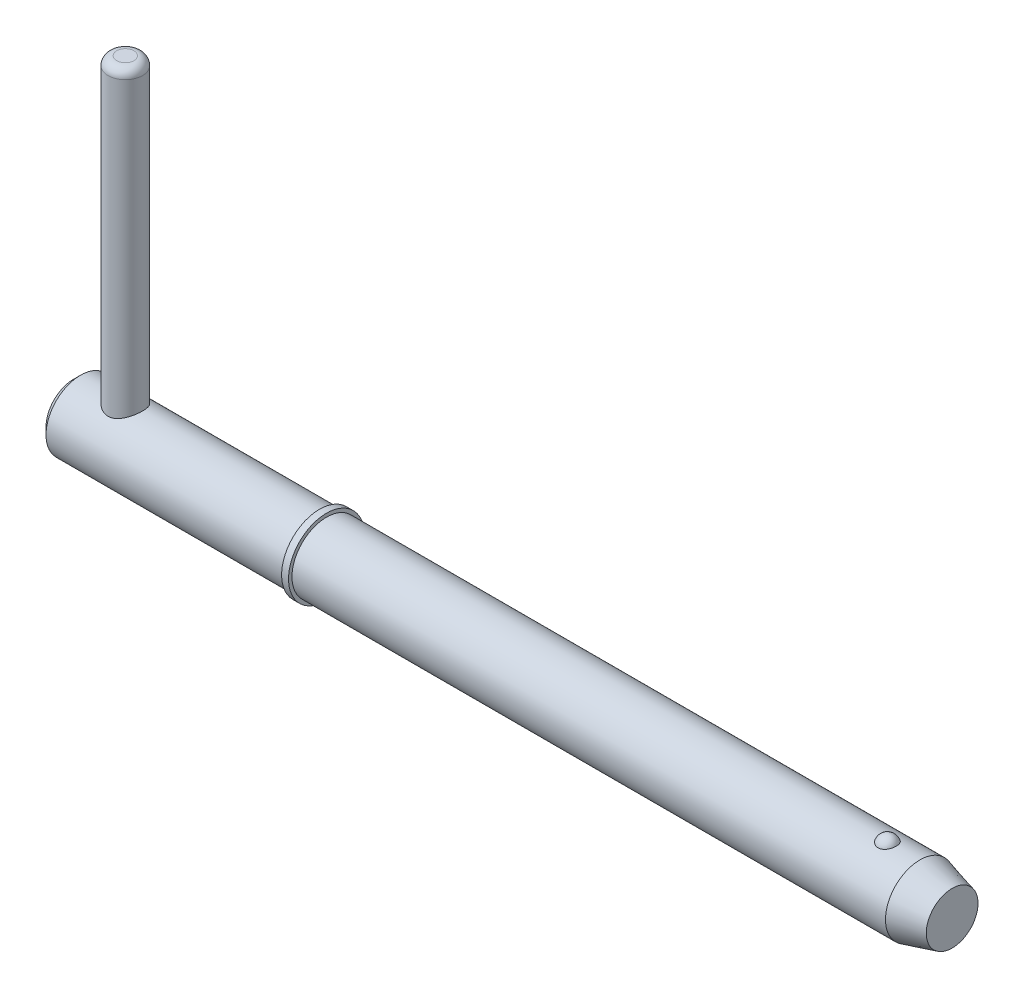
ISO-10303-21;
HEADER;
FILE_DESCRIPTION(('STEP AP214'),'2;1');
FILE_NAME('part.step','',(''),(''),'','','');
FILE_SCHEMA(('AUTOMOTIVE_DESIGN { 1 0 10303 214 1 1 1 1 }'));
ENDSEC;
DATA;
#1=APPLICATION_CONTEXT('core data for automotive mechanical design processes');
#2=APPLICATION_PROTOCOL_DEFINITION('international standard','automotive_design',2000,#1);
#3=PRODUCT_CONTEXT('',#1,'mechanical');
#4=PRODUCT('Part','Part','',(#3));
#5=PRODUCT_RELATED_PRODUCT_CATEGORY('part','',(#4));
#6=PRODUCT_DEFINITION_FORMATION('','',#4);
#7=PRODUCT_DEFINITION_CONTEXT('part definition',#1,'design');
#8=PRODUCT_DEFINITION('design','',#6,#7);
#9=PRODUCT_DEFINITION_SHAPE('','',#8);
#10=(LENGTH_UNIT() NAMED_UNIT(*) SI_UNIT(.MILLI.,.METRE.));
#11=(NAMED_UNIT(*) PLANE_ANGLE_UNIT() SI_UNIT($,.RADIAN.));
#12=(NAMED_UNIT(*) SI_UNIT($,.STERADIAN.) SOLID_ANGLE_UNIT());
#13=UNCERTAINTY_MEASURE_WITH_UNIT(LENGTH_MEASURE(1.E-05),#10,'distance_accuracy_value','');
#14=(GEOMETRIC_REPRESENTATION_CONTEXT(3) GLOBAL_UNCERTAINTY_ASSIGNED_CONTEXT((#13)) GLOBAL_UNIT_ASSIGNED_CONTEXT((#10,
#11,#12)) REPRESENTATION_CONTEXT('',''));
#15=CARTESIAN_POINT('',(0.,0.,0.));
#16=DIRECTION('',(0.,0.,1.));
#17=DIRECTION('',(1.,0.,0.));
#18=AXIS2_PLACEMENT_3D('',#15,#16,#17);
#19=CARTESIAN_POINT('',(3.57,23.02,0.));
#20=DIRECTION('',(0.,-1.,0.));
#21=DIRECTION('',(0.,0.,-1.));
#22=AXIS2_PLACEMENT_3D('',#19,#20,#21);
#23=CYLINDRICAL_SURFACE('',#22,1.19);
#24=CARTESIAN_POINT('',(3.57,-1.785,0.));
#25=DIRECTION('',(0.,1.,0.));
#26=DIRECTION('',(0.,0.,1.));
#27=AXIS2_PLACEMENT_3D('',#24,#25,#26);
#28=CIRCLE('',#27,1.19);
#29=CARTESIAN_POINT('',(3.57,-1.785,1.19));
#30=VERTEX_POINT('',#29);
#31=EDGE_CURVE('P0_E25',#30,#30,#28,.T.);
#32=ORIENTED_EDGE('',*,*,#31,.T.);
#33=EDGE_LOOP('',(#32));
#34=FACE_BOUND('',#33,.T.);
#35=CARTESIAN_POINT('',(3.57,22.425,0.));
#36=DIRECTION('',(0.,1.,0.));
#37=DIRECTION('',(0.,0.,1.));
#38=AXIS2_PLACEMENT_3D('',#35,#36,#37);
#39=CIRCLE('',#38,1.19);
#40=CARTESIAN_POINT('',(3.57,22.425,1.19));
#41=VERTEX_POINT('',#40);
#42=EDGE_CURVE('P0_E29',#41,#41,#39,.F.);
#43=ORIENTED_EDGE('',*,*,#42,.T.);
#44=EDGE_LOOP('',(#43));
#45=FACE_BOUND('',#44,.T.);
#46=ADVANCED_FACE('P0_F14',(#34,#45),#23,.T.);
#47=CARTESIAN_POINT('',(3.57,23.02,0.));
#48=DIRECTION('',(0.,1.,0.));
#49=DIRECTION('',(0.,0.,1.));
#50=AXIS2_PLACEMENT_3D('',#47,#48,#49);
#51=PLANE('',#50);
#52=CARTESIAN_POINT('',(3.57,23.02,0.));
#53=DIRECTION('',(0.,1.,0.));
#54=DIRECTION('',(0.,0.,1.));
#55=AXIS2_PLACEMENT_3D('',#52,#53,#54);
#56=CIRCLE('',#55,0.595);
#57=CARTESIAN_POINT('',(3.57,23.02,0.595));
#58=VERTEX_POINT('',#57);
#59=EDGE_CURVE('P0_E10',#58,#58,#56,.T.);
#60=ORIENTED_EDGE('',*,*,#59,.T.);
#61=EDGE_LOOP('',(#60));
#62=FACE_BOUND('',#61,.T.);
#63=ADVANCED_FACE('P0_F46',(#62),#51,.T.);
#64=CARTESIAN_POINT('',(3.57,-2.38,0.));
#65=DIRECTION('',(0.,1.,0.));
#66=DIRECTION('',(0.,0.,1.));
#67=AXIS2_PLACEMENT_3D('',#64,#65,#66);
#68=PLANE('',#67);
#69=CARTESIAN_POINT('',(3.57,-2.38,0.));
#70=DIRECTION('',(0.,1.,0.));
#71=DIRECTION('',(0.,0.,1.));
#72=AXIS2_PLACEMENT_3D('',#69,#70,#71);
#73=CIRCLE('',#72,0.595);
#74=CARTESIAN_POINT('',(3.57,-2.38,0.595));
#75=VERTEX_POINT('',#74);
#76=EDGE_CURVE('P0_E21',#75,#75,#73,.F.);
#77=ORIENTED_EDGE('',*,*,#76,.T.);
#78=EDGE_LOOP('',(#77));
#79=FACE_BOUND('',#78,.T.);
#80=ADVANCED_FACE('P0_F43',(#79),#68,.F.);
#81=CARTESIAN_POINT('',(3.57,-1.785,0.));
#82=DIRECTION('',(0.,1.,0.));
#83=DIRECTION('',(0.,0.,1.));
#84=AXIS2_PLACEMENT_3D('',#81,#82,#83);
#85=DEGENERATE_TOROIDAL_SURFACE('',#84,0.595,0.595,.T.);
#86=ORIENTED_EDGE('',*,*,#76,.F.);
#87=EDGE_LOOP('',(#86));
#88=FACE_BOUND('',#87,.T.);
#89=ORIENTED_EDGE('',*,*,#31,.F.);
#90=EDGE_LOOP('',(#89));
#91=FACE_BOUND('',#90,.T.);
#92=ADVANCED_FACE('P0_F38',(#88,#91),#85,.T.);
#93=CARTESIAN_POINT('',(3.57,22.425,0.));
#94=DIRECTION('',(0.,1.,0.));
#95=DIRECTION('',(0.,0.,1.));
#96=AXIS2_PLACEMENT_3D('',#93,#94,#95);
#97=DEGENERATE_TOROIDAL_SURFACE('',#96,0.595,0.595,.T.);
#98=ORIENTED_EDGE('',*,*,#42,.F.);
#99=EDGE_LOOP('',(#98));
#100=FACE_BOUND('',#99,.T.);
#101=ORIENTED_EDGE('',*,*,#59,.F.);
#102=EDGE_LOOP('',(#101));
#103=FACE_BOUND('',#102,.T.);
#104=ADVANCED_FACE('P0_F16',(#100,#103),#97,.T.);
#105=CLOSED_SHELL('',(#46,#63,#80,#92,#104));
#106=MANIFOLD_SOLID_BREP('P0_B1',#105);
#107=CARTESIAN_POINT('',(0.,0.,0.));
#108=DIRECTION('',(1.,0.,0.));
#109=DIRECTION('',(0.,0.,-1.));
#110=AXIS2_PLACEMENT_3D('',#107,#108,#109);
#111=CYLINDRICAL_SURFACE('',#110,2.38);
#112=CARTESIAN_POINT('',(58.4094297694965,0.,0.));
#113=DIRECTION('',(1.,0.,0.));
#114=DIRECTION('',(0.,0.,-1.));
#115=AXIS2_PLACEMENT_3D('',#112,#113,#114);
#116=CIRCLE('',#115,2.38);
#117=CARTESIAN_POINT('',(58.4094297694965,0.,-2.38));
#118=VERTEX_POINT('',#117);
#119=EDGE_CURVE('P1_E81',#118,#118,#116,.T.);
#120=ORIENTED_EDGE('',*,*,#119,.F.);
#121=EDGE_LOOP('',(#120));
#122=FACE_BOUND('',#121,.T.);
#123=CARTESIAN_POINT('',(17.45,0.,0.));
#124=DIRECTION('',(1.,0.,0.));
#125=DIRECTION('',(0.,0.,-1.));
#126=AXIS2_PLACEMENT_3D('',#123,#124,#125);
#127=CIRCLE('',#126,2.38);
#128=CARTESIAN_POINT('',(17.45,0.,-2.38));
#129=VERTEX_POINT('',#128);
#130=EDGE_CURVE('P1_E85',#129,#129,#127,.T.);
#131=ORIENTED_EDGE('',*,*,#130,.T.);
#132=EDGE_LOOP('',(#131));
#133=FACE_BOUND('',#132,.T.);
#134=CARTESIAN_POINT('',(56.1634492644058,2.2921568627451,0.640637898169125));
#135=CARTESIAN_POINT('',(56.1303559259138,2.29215737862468,0.640637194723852));
#136=CARTESIAN_POINT('',(56.0972546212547,2.29293179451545,0.637884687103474));
#137=CARTESIAN_POINT('',(56.0320176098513,2.29594030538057,0.626968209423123));
#138=CARTESIAN_POINT('',(55.9998823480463,2.29817506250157,0.618801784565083));
#139=CARTESIAN_POINT('',(55.9375402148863,2.30384308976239,0.597351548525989));
#140=CARTESIAN_POINT('',(55.9073305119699,2.30727454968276,0.584075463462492));
#141=CARTESIAN_POINT('',(55.8495674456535,2.31495941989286,0.552829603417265));
#142=CARTESIAN_POINT('',(55.8220141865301,2.31921286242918,0.534859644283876));
#143=CARTESIAN_POINT('',(55.7695938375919,2.32820213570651,0.494282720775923));
#144=CARTESIAN_POINT('',(55.7448050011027,2.33294694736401,0.471576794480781));
#145=CARTESIAN_POINT('',(55.6992169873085,2.34234144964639,0.422446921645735));
#146=CARTESIAN_POINT('',(55.6784185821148,2.34699112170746,0.396022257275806));
#147=CARTESIAN_POINT('',(55.6403580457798,2.35593942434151,0.338855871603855));
#148=CARTESIAN_POINT('',(55.6233051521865,2.36021170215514,0.30797060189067));
#149=CARTESIAN_POINT('',(55.5943607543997,2.3677057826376,0.243750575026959));
#150=CARTESIAN_POINT('',(55.5824701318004,2.37092740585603,0.210415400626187));
#151=CARTESIAN_POINT('',(55.5638076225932,2.37606901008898,0.141189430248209));
#152=CARTESIAN_POINT('',(55.5571956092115,2.37794816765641,0.105252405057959));
#153=CARTESIAN_POINT('',(55.5498095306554,2.38005135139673,0.0327351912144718));
#154=CARTESIAN_POINT('',(55.5490358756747,2.38027526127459,-0.00384504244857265));
#155=CARTESIAN_POINT('',(55.5533628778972,2.37903842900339,-0.0769838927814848));
#156=CARTESIAN_POINT('',(55.5585202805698,2.37756141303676,-0.113538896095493));
#157=CARTESIAN_POINT('',(55.5747013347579,2.37305303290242,-0.185229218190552));
#158=CARTESIAN_POINT('',(55.5857251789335,2.37002161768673,-0.220364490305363));
#159=CARTESIAN_POINT('',(55.6133977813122,2.36273722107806,-0.288156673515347));
#160=CARTESIAN_POINT('',(55.6300389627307,2.35848588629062,-0.32081685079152));
#161=CARTESIAN_POINT('',(55.6685984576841,2.34923130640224,-0.382744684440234));
#162=CARTESIAN_POINT('',(55.690516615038,2.34422808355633,-0.412012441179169));
#163=CARTESIAN_POINT('',(55.7387549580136,2.33412555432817,-0.465830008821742));
#164=CARTESIAN_POINT('',(55.765002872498,2.32902887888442,-0.490444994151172));
#165=CARTESIAN_POINT('',(55.8214769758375,2.31926941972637,-0.534700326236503));
#166=CARTESIAN_POINT('',(55.851702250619,2.3146065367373,-0.554341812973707));
#167=CARTESIAN_POINT('',(55.9140618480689,2.30645675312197,-0.58731242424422));
#168=CARTESIAN_POINT('',(55.9460780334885,2.30293152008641,-0.600855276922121));
#169=CARTESIAN_POINT('',(56.0120795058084,2.29725171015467,-0.622220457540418));
#170=CARTESIAN_POINT('',(56.0460641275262,2.29509667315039,-0.630044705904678));
#171=CARTESIAN_POINT('',(56.113299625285,2.29249264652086,-0.639452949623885));
#172=CARTESIAN_POINT('',(56.1465087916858,2.29196755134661,-0.641315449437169));
#173=CARTESIAN_POINT('',(56.2127631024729,2.29246849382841,-0.639522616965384));
#174=CARTESIAN_POINT('',(56.2458082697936,2.29349430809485,-0.635868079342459));
#175=CARTESIAN_POINT('',(56.3101025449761,2.29694059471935,-0.623301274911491));
#176=CARTESIAN_POINT('',(56.3413744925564,2.29933234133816,-0.61449721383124));
#177=CARTESIAN_POINT('',(56.4019952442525,2.30522511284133,-0.592006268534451));
#178=CARTESIAN_POINT('',(56.4313438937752,2.30872622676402,-0.578318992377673));
#179=CARTESIAN_POINT('',(56.4880369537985,2.31655795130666,-0.546112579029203));
#180=CARTESIAN_POINT('',(56.515320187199,2.32090569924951,-0.527490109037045));
#181=CARTESIAN_POINT('',(56.5664904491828,2.32992206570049,-0.486117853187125));
#182=CARTESIAN_POINT('',(56.5903767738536,2.33459075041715,-0.463367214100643));
#183=CARTESIAN_POINT('',(56.6352722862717,2.34399834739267,-0.413220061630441));
#184=CARTESIAN_POINT('',(56.6560972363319,2.34873051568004,-0.385657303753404));
#185=CARTESIAN_POINT('',(56.693056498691,2.35754932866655,-0.327455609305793));
#186=CARTESIAN_POINT('',(56.7091898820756,2.36163584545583,-0.29681606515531));
#187=CARTESIAN_POINT('',(56.7369822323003,2.36889321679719,-0.232047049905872));
#188=CARTESIAN_POINT('',(56.7484450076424,2.37202275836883,-0.197828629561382));
#189=CARTESIAN_POINT('',(56.7657523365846,2.37681926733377,-0.127900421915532));
#190=CARTESIAN_POINT('',(56.7715962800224,2.37848607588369,-0.0921904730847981));
#191=CARTESIAN_POINT('',(56.777605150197,2.38020024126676,-0.0196348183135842));
#192=CARTESIAN_POINT('',(56.7776704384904,2.38021918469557,0.0172198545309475));
#193=CARTESIAN_POINT('',(56.7718689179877,2.37856356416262,0.0904219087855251));
#194=CARTESIAN_POINT('',(56.7660018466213,2.37688892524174,0.126769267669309));
#195=CARTESIAN_POINT('',(56.748425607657,2.37201688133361,0.198028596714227));
#196=CARTESIAN_POINT('',(56.736699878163,2.36881516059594,0.232936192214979));
#197=CARTESIAN_POINT('',(56.7076354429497,2.36123444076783,0.300196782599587));
#198=CARTESIAN_POINT('',(56.6902967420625,2.3568554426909,0.332549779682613));
#199=CARTESIAN_POINT('',(56.6505350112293,2.34744667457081,0.393495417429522));
#200=CARTESIAN_POINT('',(56.6281528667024,2.34242227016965,0.422115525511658));
#201=CARTESIAN_POINT('',(56.5787391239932,2.33227293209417,0.475004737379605));
#202=CARTESIAN_POINT('',(56.5517076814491,2.32714800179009,0.499273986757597));
#203=CARTESIAN_POINT('',(56.4944988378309,2.31755359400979,0.54204602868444));
#204=CARTESIAN_POINT('',(56.4644297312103,2.3130698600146,0.560690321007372));
#205=CARTESIAN_POINT('',(56.4013869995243,2.3051412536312,0.592447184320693));
#206=CARTESIAN_POINT('',(56.3684158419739,2.30169550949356,0.605564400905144));
#207=CARTESIAN_POINT('',(56.3068424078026,2.29677744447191,0.623927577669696));
#208=CARTESIAN_POINT('',(56.2785555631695,2.29505839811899,0.63017893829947));
#209=CARTESIAN_POINT('',(56.2213308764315,2.29274795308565,0.638534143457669));
#210=CARTESIAN_POINT('',(56.1923931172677,2.29215641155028,0.640638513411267));
#211=CARTESIAN_POINT('',(56.1634492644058,2.2921568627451,0.640637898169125));
#212=B_SPLINE_CURVE_WITH_KNOTS('',3,(#134,#135,#136,#137,#138,#139,#140,#141,#142,#143,#144,
#145,#146,#147,#148,#149,#150,#151,#152,#153,#154,#155,#156,#157,#158,#159,#160,#161,#162,#163,
#164,#165,#166,#167,#168,#169,#170,#171,#172,#173,#174,#175,#176,#177,#178,#179,#180,#181,#182,
#183,#184,#185,#186,#187,#188,#189,#190,#191,#192,#193,#194,#195,#196,#197,#198,#199,#200,#201,
#202,#203,#204,#205,#206,#207,#208,#209,#210,#211),.UNSPECIFIED.,.T.,.F.,(4,2,2,2,2,2,2,2,2,2,2,
2,2,2,2,2,2,2,2,2,2,2,2,2,2,2,2,2,2,2,2,2,2,2,2,2,2,2,4),(0.,0.0991724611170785,
0.198389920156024,0.297457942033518,0.396529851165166,0.497927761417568,0.599345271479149,
0.705475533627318,0.811623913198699,0.92087671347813,1.03013718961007,1.14045177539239,
1.25076998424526,1.36093998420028,1.47110672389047,1.57959248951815,1.6880533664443,
1.79234266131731,1.89659691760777,1.9959039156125,2.09519661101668,2.1924742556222,
2.28975970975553,2.38926978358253,2.48880044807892,2.59293588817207,2.6970919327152,
2.8052582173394,2.91343624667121,3.02347917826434,3.13352698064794,3.24388765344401,
3.35424823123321,3.46374443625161,3.57323697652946,3.67968690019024,3.78604717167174,
3.87279565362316,3.95953314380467),.UNSPECIFIED.);
#213=CARTESIAN_POINT('',(56.1634492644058,2.2921568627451,0.640637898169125));
#214=VERTEX_POINT('',#213);
#215=EDGE_CURVE('P1_E35',#214,#214,#212,.T.);
#216=ORIENTED_EDGE('',*,*,#215,.T.);
#217=EDGE_LOOP('',(#216));
#218=FACE_BOUND('',#217,.T.);
#219=ADVANCED_FACE('P1_F13',(#122,#133,#218),#111,.T.);
#220=CARTESIAN_POINT('',(0.,0.,0.));
#221=DIRECTION('',(-1.,0.,0.));
#222=DIRECTION('',(0.,0.,1.));
#223=AXIS2_PLACEMENT_3D('',#220,#221,#222);
#224=PLANE('',#223);
#225=CARTESIAN_POINT('',(0.,0.,0.));
#226=DIRECTION('',(1.,0.,0.));
#227=DIRECTION('',(0.,0.,-1.));
#228=AXIS2_PLACEMENT_3D('',#225,#226,#227);
#229=CIRCLE('',#228,1.904);
#230=CARTESIAN_POINT('',(0.,0.,-1.904));
#231=VERTEX_POINT('',#230);
#232=EDGE_CURVE('P1_E9',#231,#231,#229,.T.);
#233=ORIENTED_EDGE('',*,*,#232,.F.);
#234=EDGE_LOOP('',(#233));
#235=FACE_BOUND('',#234,.T.);
#236=ADVANCED_FACE('P1_F15',(#235),#224,.T.);
#237=CARTESIAN_POINT('',(0.475999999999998,0.,0.));
#238=DIRECTION('',(1.,0.,0.));
#239=DIRECTION('',(0.,0.,-1.));
#240=AXIS2_PLACEMENT_3D('',#237,#238,#239);
#241=CONICAL_SURFACE('',#240,2.38,0.78539816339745);
#242=ORIENTED_EDGE('',*,*,#232,.T.);
#243=EDGE_LOOP('',(#242));
#244=FACE_BOUND('',#243,.T.);
#245=CARTESIAN_POINT('',(0.475999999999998,0.,0.));
#246=DIRECTION('',(1.,0.,0.));
#247=DIRECTION('',(0.,0.,-1.));
#248=AXIS2_PLACEMENT_3D('',#245,#246,#247);
#249=CIRCLE('',#248,2.38);
#250=CARTESIAN_POINT('',(0.475999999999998,0.,-2.38));
#251=VERTEX_POINT('',#250);
#252=EDGE_CURVE('P1_E26',#251,#251,#249,.T.);
#253=ORIENTED_EDGE('',*,*,#252,.F.);
#254=EDGE_LOOP('',(#253));
#255=FACE_BOUND('',#254,.T.);
#256=ADVANCED_FACE('P1_F77',(#244,#255),#241,.T.);
#257=CARTESIAN_POINT('',(0.,0.,0.));
#258=DIRECTION('',(1.,0.,0.));
#259=DIRECTION('',(0.,0.,-1.));
#260=AXIS2_PLACEMENT_3D('',#257,#258,#259);
#261=CYLINDRICAL_SURFACE('',#260,2.38);
#262=CARTESIAN_POINT('',(3.57,-2.06114046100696,1.19));
#263=CARTESIAN_POINT('',(3.50799170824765,-2.06114586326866,1.18999567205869));
#264=CARTESIAN_POINT('',(3.4459051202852,-2.0639812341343,1.18512096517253));
#265=CARTESIAN_POINT('',(3.32363755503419,-2.07491216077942,1.16587061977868));
#266=CARTESIAN_POINT('',(3.26346086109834,-2.08301876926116,1.15147501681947));
#267=CARTESIAN_POINT('',(3.14701251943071,-2.10331722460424,1.11395893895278));
#268=CARTESIAN_POINT('',(3.09072196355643,-2.1154873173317,1.09088484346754));
#269=CARTESIAN_POINT('',(2.9828251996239,-2.14250771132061,1.03680835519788));
#270=CARTESIAN_POINT('',(2.93121924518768,-2.15735815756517,1.00580553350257));
#271=CARTESIAN_POINT('',(2.82945618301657,-2.18956274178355,0.933753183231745));
#272=CARTESIAN_POINT('',(2.77976962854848,-2.20702235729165,0.892085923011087));
#273=CARTESIAN_POINT('',(2.68772401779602,-2.2416265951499,0.801172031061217));
#274=CARTESIAN_POINT('',(2.64536861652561,-2.25877105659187,0.751921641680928));
#275=CARTESIAN_POINT('',(2.56639309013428,-2.29219557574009,0.64318258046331));
#276=CARTESIAN_POINT('',(2.53035201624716,-2.30833946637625,0.583227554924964));
#277=CARTESIAN_POINT('',(2.46908238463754,-2.3365739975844,0.45714686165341));
#278=CARTESIAN_POINT('',(2.44384700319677,-2.34866719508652,0.391025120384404));
#279=CARTESIAN_POINT('',(2.40676945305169,-2.36667748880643,0.259473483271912));
#280=CARTESIAN_POINT('',(2.39410206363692,-2.37297281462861,0.194329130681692));
#281=CARTESIAN_POINT('',(2.3798023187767,-2.3800902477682,0.0625590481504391));
#282=CARTESIAN_POINT('',(2.37816328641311,-2.38091566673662,-0.00406576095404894));
#283=CARTESIAN_POINT('',(2.38564854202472,-2.37717948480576,-0.130700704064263));
#284=CARTESIAN_POINT('',(2.39384923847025,-2.37308010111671,-0.190782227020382));
#285=CARTESIAN_POINT('',(2.41912820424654,-2.360653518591,-0.308583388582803));
#286=CARTESIAN_POINT('',(2.43620713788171,-2.35232600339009,-0.366302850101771));
#287=CARTESIAN_POINT('',(2.47886825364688,-2.33206184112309,-0.478748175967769));
#288=CARTESIAN_POINT('',(2.50456481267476,-2.32007685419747,-0.533421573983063));
#289=CARTESIAN_POINT('',(2.56357346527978,-2.29357798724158,-0.637812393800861));
#290=CARTESIAN_POINT('',(2.5968882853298,-2.27906320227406,-0.687528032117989));
#291=CARTESIAN_POINT('',(2.67380546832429,-2.24724829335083,-0.785606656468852));
#292=CARTESIAN_POINT('',(2.71808260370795,-2.22981457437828,-0.833397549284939));
#293=CARTESIAN_POINT('',(2.81386177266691,-2.19500665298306,-0.921184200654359));
#294=CARTESIAN_POINT('',(2.86536931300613,-2.17763250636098,-0.961173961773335));
#295=CARTESIAN_POINT('',(2.97815134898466,-2.14371545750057,-1.03471134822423));
#296=CARTESIAN_POINT('',(3.03983836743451,-2.12729540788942,-1.06768860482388));
#297=CARTESIAN_POINT('',(3.16889582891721,-2.09886785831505,-1.12254974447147));
#298=CARTESIAN_POINT('',(3.2362602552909,-2.0868557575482,-1.14444520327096));
#299=CARTESIAN_POINT('',(3.36914526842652,-2.06994116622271,-1.1747444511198));
#300=CARTESIAN_POINT('',(3.43438893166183,-2.06455070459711,-1.18407989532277));
#301=CARTESIAN_POINT('',(3.56571759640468,-2.06010324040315,-1.1918051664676));
#302=CARTESIAN_POINT('',(3.63180197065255,-2.06104176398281,-1.19020272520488));
#303=CARTESIAN_POINT('',(3.75522816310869,-2.06862860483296,-1.17695289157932));
#304=CARTESIAN_POINT('',(3.81273554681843,-2.07464109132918,-1.16642350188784));
#305=CARTESIAN_POINT('',(3.92505766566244,-2.09075885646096,-1.1372785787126));
#306=CARTESIAN_POINT('',(3.97987152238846,-2.1008654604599,-1.1186604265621));
#307=CARTESIAN_POINT('',(4.08813948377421,-2.12458104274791,-1.07296063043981));
#308=CARTESIAN_POINT('',(4.14141303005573,-2.13833055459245,-1.04552693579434));
#309=CARTESIAN_POINT('',(4.2429084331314,-2.16765782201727,-0.983281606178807));
#310=CARTESIAN_POINT('',(4.29112767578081,-2.18323651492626,-0.948466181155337));
#311=CARTESIAN_POINT('',(4.38750473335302,-2.2168271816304,-0.867316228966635));
#312=CARTESIAN_POINT('',(4.43488860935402,-2.23489833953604,-0.82008287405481));
#313=CARTESIAN_POINT('',(4.52130056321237,-2.26973739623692,-0.718051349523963));
#314=CARTESIAN_POINT('',(4.56032581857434,-2.28650485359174,-0.663250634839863));
#315=CARTESIAN_POINT('',(4.62978273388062,-2.31742220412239,-0.545657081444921));
#316=CARTESIAN_POINT('',(4.65996041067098,-2.33149133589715,-0.482691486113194));
#317=CARTESIAN_POINT('',(4.7089941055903,-2.35481192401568,-0.351671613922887));
#318=CARTESIAN_POINT('',(4.7278600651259,-2.36406760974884,-0.283621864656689));
#319=CARTESIAN_POINT('',(4.75210859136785,-2.3760433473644,-0.151105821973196));
#320=CARTESIAN_POINT('',(4.75856947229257,-2.37928514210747,-0.0868836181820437));
#321=CARTESIAN_POINT('',(4.76100348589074,-2.38050135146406,0.0417999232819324));
#322=CARTESIAN_POINT('',(4.75698028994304,-2.37847760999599,0.106261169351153));
#323=CARTESIAN_POINT('',(4.73927447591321,-2.36969422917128,0.229120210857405));
#324=CARTESIAN_POINT('',(4.72624582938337,-2.36325544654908,0.287637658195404));
#325=CARTESIAN_POINT('',(4.69178087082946,-2.34658591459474,0.401560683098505));
#326=CARTESIAN_POINT('',(4.67034335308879,-2.33635462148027,0.456965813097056));
#327=CARTESIAN_POINT('',(4.61871480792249,-2.31247857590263,0.565753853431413));
#328=CARTESIAN_POINT('',(4.58818860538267,-2.29870654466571,0.618948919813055));
#329=CARTESIAN_POINT('',(4.51967006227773,-2.26918878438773,0.719681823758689));
#330=CARTESIAN_POINT('',(4.48167429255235,-2.25344215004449,0.76721704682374));
#331=CARTESIAN_POINT('',(4.39491140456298,-2.21969046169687,0.860267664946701));
#332=CARTESIAN_POINT('',(4.34544863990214,-2.20161660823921,0.905111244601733));
#333=CARTESIAN_POINT('',(4.23943364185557,-2.16655060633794,0.986109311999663));
#334=CARTESIAN_POINT('',(4.18287520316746,-2.1495594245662,1.02225611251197));
#335=CARTESIAN_POINT('',(4.06190239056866,-2.1181953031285,1.08579298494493));
#336=CARTESIAN_POINT('',(3.9972962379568,-2.10392207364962,1.11287022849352));
#337=CARTESIAN_POINT('',(3.86353443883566,-2.08090726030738,1.15534566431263));
#338=CARTESIAN_POINT('',(3.7943948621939,-2.07214719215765,1.17078291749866));
#339=CARTESIAN_POINT('',(3.69875162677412,-2.06499834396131,1.18329673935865));
#340=CARTESIAN_POINT('',(3.67309220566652,-2.06355673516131,1.18580656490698));
#341=CARTESIAN_POINT('',(3.62162638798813,-2.06162663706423,1.18915915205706));
#342=CARTESIAN_POINT('',(3.59581998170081,-2.0611382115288,1.19000180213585));
#343=CARTESIAN_POINT('',(3.57,-2.06114046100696,1.19));
#344=B_SPLINE_CURVE_WITH_KNOTS('',3,(#262,#263,#264,#265,#266,#267,#268,#269,#270,#271,#272,
#273,#274,#275,#276,#277,#278,#279,#280,#281,#282,#283,#284,#285,#286,#287,#288,#289,#290,#291,
#292,#293,#294,#295,#296,#297,#298,#299,#300,#301,#302,#303,#304,#305,#306,#307,#308,#309,#310,
#311,#312,#313,#314,#315,#316,#317,#318,#319,#320,#321,#322,#323,#324,#325,#326,#327,#328,#329,
#330,#331,#332,#333,#334,#335,#336,#337,#338,#339,#340,#341,#342,#343),.UNSPECIFIED.,.T.,.F.,(4,
2,2,2,2,2,2,2,2,2,2,2,2,2,2,2,2,2,2,2,2,2,2,2,2,2,2,2,2,2,2,2,2,2,2,2,2,2,2,2,4),(0.,
0.185916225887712,0.372223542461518,0.557549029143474,0.742884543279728,0.943506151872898,
1.14422749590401,1.35847891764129,1.5725948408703,1.77147547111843,1.97023568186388,
2.15171156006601,2.33320101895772,2.51720146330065,2.70126786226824,2.902733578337,
3.10435357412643,3.31877721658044,3.53297641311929,3.73020126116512,3.92728670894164,
4.1028127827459,4.27839572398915,4.46211082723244,4.64592048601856,4.8529002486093,
5.0599497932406,5.27246375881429,5.48479067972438,5.67763601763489,5.87041383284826,
6.05048865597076,6.23058930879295,6.41839293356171,6.60628297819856,6.8128718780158,
7.01964271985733,7.2329479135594,7.44553408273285,7.52294360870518,7.60035831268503),.UNSPECIFIED.);
#345=CARTESIAN_POINT('',(3.57,-2.06114046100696,1.19));
#346=VERTEX_POINT('',#345);
#347=EDGE_CURVE('P1_E17',#346,#346,#344,.T.);
#348=ORIENTED_EDGE('',*,*,#347,.F.);
#349=EDGE_LOOP('',(#348));
#350=FACE_BOUND('',#349,.T.);
#351=CARTESIAN_POINT('',(3.57,2.06114046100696,1.19));
#352=CARTESIAN_POINT('',(3.63200829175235,2.06114586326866,1.18999567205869));
#353=CARTESIAN_POINT('',(3.6940948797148,2.0639812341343,1.18512096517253));
#354=CARTESIAN_POINT('',(3.81636244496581,2.07491216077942,1.16587061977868));
#355=CARTESIAN_POINT('',(3.87653913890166,2.08301876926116,1.15147501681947));
#356=CARTESIAN_POINT('',(3.99298748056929,2.10331722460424,1.11395893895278));
#357=CARTESIAN_POINT('',(4.04927803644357,2.1154873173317,1.09088484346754));
#358=CARTESIAN_POINT('',(4.1571748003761,2.14250771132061,1.03680835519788));
#359=CARTESIAN_POINT('',(4.20878075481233,2.15735815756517,1.00580553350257));
#360=CARTESIAN_POINT('',(4.31054381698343,2.18956274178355,0.933753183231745));
#361=CARTESIAN_POINT('',(4.36023037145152,2.20702235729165,0.892085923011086));
#362=CARTESIAN_POINT('',(4.45227598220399,2.2416265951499,0.801172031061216));
#363=CARTESIAN_POINT('',(4.49463138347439,2.25877105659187,0.751921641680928));
#364=CARTESIAN_POINT('',(4.57360690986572,2.29219557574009,0.643182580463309));
#365=CARTESIAN_POINT('',(4.60964798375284,2.30833946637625,0.583227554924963));
#366=CARTESIAN_POINT('',(4.67091761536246,2.3365739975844,0.457146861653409));
#367=CARTESIAN_POINT('',(4.69615299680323,2.34866719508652,0.391025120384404));
#368=CARTESIAN_POINT('',(4.73323054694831,2.36667748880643,0.259473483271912));
#369=CARTESIAN_POINT('',(4.74589793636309,2.37297281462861,0.194329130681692));
#370=CARTESIAN_POINT('',(4.7601976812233,2.3800902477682,0.0625590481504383));
#371=CARTESIAN_POINT('',(4.76183671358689,2.38091566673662,-0.00406576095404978));
#372=CARTESIAN_POINT('',(4.75435145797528,2.37717948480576,-0.130700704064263));
#373=CARTESIAN_POINT('',(4.74615076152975,2.37308010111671,-0.190782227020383));
#374=CARTESIAN_POINT('',(4.72087179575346,2.360653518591,-0.308583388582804));
#375=CARTESIAN_POINT('',(4.70379286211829,2.35232600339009,-0.366302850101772));
#376=CARTESIAN_POINT('',(4.66113174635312,2.33206184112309,-0.478748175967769));
#377=CARTESIAN_POINT('',(4.63543518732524,2.32007685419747,-0.533421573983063));
#378=CARTESIAN_POINT('',(4.57642653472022,2.29357798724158,-0.637812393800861));
#379=CARTESIAN_POINT('',(4.5431117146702,2.27906320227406,-0.687528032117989));
#380=CARTESIAN_POINT('',(4.46619453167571,2.24724829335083,-0.785606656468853));
#381=CARTESIAN_POINT('',(4.42191739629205,2.22981457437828,-0.83339754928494));
#382=CARTESIAN_POINT('',(4.32613822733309,2.19500665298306,-0.921184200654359));
#383=CARTESIAN_POINT('',(4.27463068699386,2.17763250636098,-0.961173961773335));
#384=CARTESIAN_POINT('',(4.16184865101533,2.14371545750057,-1.03471134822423));
#385=CARTESIAN_POINT('',(4.10016163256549,2.12729540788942,-1.06768860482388));
#386=CARTESIAN_POINT('',(3.97110417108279,2.09886785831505,-1.12254974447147));
#387=CARTESIAN_POINT('',(3.9037397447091,2.0868557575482,-1.14444520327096));
#388=CARTESIAN_POINT('',(3.77085473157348,2.06994116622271,-1.1747444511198));
#389=CARTESIAN_POINT('',(3.70561106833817,2.06455070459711,-1.18407989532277));
#390=CARTESIAN_POINT('',(3.57428240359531,2.06010324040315,-1.1918051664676));
#391=CARTESIAN_POINT('',(3.50819802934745,2.06104176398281,-1.19020272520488));
#392=CARTESIAN_POINT('',(3.38477183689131,2.06862860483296,-1.17695289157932));
#393=CARTESIAN_POINT('',(3.32726445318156,2.07464109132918,-1.16642350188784));
#394=CARTESIAN_POINT('',(3.21494233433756,2.09075885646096,-1.1372785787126));
#395=CARTESIAN_POINT('',(3.16012847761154,2.1008654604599,-1.1186604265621));
#396=CARTESIAN_POINT('',(3.05186051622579,2.12458104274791,-1.07296063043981));
#397=CARTESIAN_POINT('',(2.99858696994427,2.13833055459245,-1.04552693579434));
#398=CARTESIAN_POINT('',(2.8970915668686,2.16765782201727,-0.983281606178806));
#399=CARTESIAN_POINT('',(2.84887232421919,2.18323651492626,-0.948466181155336));
#400=CARTESIAN_POINT('',(2.75249526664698,2.2168271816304,-0.867316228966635));
#401=CARTESIAN_POINT('',(2.70511139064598,2.23489833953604,-0.820082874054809));
#402=CARTESIAN_POINT('',(2.61869943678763,2.26973739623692,-0.718051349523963));
#403=CARTESIAN_POINT('',(2.57967418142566,2.28650485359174,-0.663250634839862));
#404=CARTESIAN_POINT('',(2.51021726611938,2.31742220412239,-0.54565708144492));
#405=CARTESIAN_POINT('',(2.48003958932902,2.33149133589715,-0.482691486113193));
#406=CARTESIAN_POINT('',(2.4310058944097,2.35481192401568,-0.351671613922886));
#407=CARTESIAN_POINT('',(2.4121399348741,2.36406760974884,-0.283621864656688));
#408=CARTESIAN_POINT('',(2.38789140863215,2.3760433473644,-0.151105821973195));
#409=CARTESIAN_POINT('',(2.38143052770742,2.37928514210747,-0.0868836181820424));
#410=CARTESIAN_POINT('',(2.37899651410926,2.38050135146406,0.0417999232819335));
#411=CARTESIAN_POINT('',(2.38301971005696,2.37847760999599,0.106261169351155));
#412=CARTESIAN_POINT('',(2.40072552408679,2.36969422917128,0.229120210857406));
#413=CARTESIAN_POINT('',(2.41375417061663,2.36325544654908,0.287637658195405));
#414=CARTESIAN_POINT('',(2.44821912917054,2.34658591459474,0.401560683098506));
#415=CARTESIAN_POINT('',(2.46965664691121,2.33635462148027,0.456965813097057));
#416=CARTESIAN_POINT('',(2.52128519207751,2.31247857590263,0.565753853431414));
#417=CARTESIAN_POINT('',(2.55181139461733,2.29870654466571,0.618948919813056));
#418=CARTESIAN_POINT('',(2.62032993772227,2.26918878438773,0.719681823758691));
#419=CARTESIAN_POINT('',(2.65832570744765,2.25344215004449,0.767217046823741));
#420=CARTESIAN_POINT('',(2.74508859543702,2.21969046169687,0.860267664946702));
#421=CARTESIAN_POINT('',(2.79455136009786,2.20161660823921,0.905111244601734));
#422=CARTESIAN_POINT('',(2.90056635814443,2.16655060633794,0.986109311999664));
#423=CARTESIAN_POINT('',(2.95712479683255,2.1495594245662,1.02225611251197));
#424=CARTESIAN_POINT('',(3.07809760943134,2.1181953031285,1.08579298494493));
#425=CARTESIAN_POINT('',(3.1427037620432,2.10392207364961,1.11287022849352));
#426=CARTESIAN_POINT('',(3.27646556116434,2.08090726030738,1.15534566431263));
#427=CARTESIAN_POINT('',(3.3456051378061,2.07214719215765,1.17078291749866));
#428=CARTESIAN_POINT('',(3.44124837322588,2.06499834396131,1.18329673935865));
#429=CARTESIAN_POINT('',(3.46690779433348,2.06355673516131,1.18580656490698));
#430=CARTESIAN_POINT('',(3.51837361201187,2.06162663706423,1.18915915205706));
#431=CARTESIAN_POINT('',(3.54418001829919,2.0611382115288,1.19000180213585));
#432=CARTESIAN_POINT('',(3.57,2.06114046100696,1.19));
#433=B_SPLINE_CURVE_WITH_KNOTS('',3,(#351,#352,#353,#354,#355,#356,#357,#358,#359,#360,#361,
#362,#363,#364,#365,#366,#367,#368,#369,#370,#371,#372,#373,#374,#375,#376,#377,#378,#379,#380,
#381,#382,#383,#384,#385,#386,#387,#388,#389,#390,#391,#392,#393,#394,#395,#396,#397,#398,#399,
#400,#401,#402,#403,#404,#405,#406,#407,#408,#409,#410,#411,#412,#413,#414,#415,#416,#417,#418,
#419,#420,#421,#422,#423,#424,#425,#426,#427,#428,#429,#430,#431,#432),.UNSPECIFIED.,.T.,.F.,(4,
2,2,2,2,2,2,2,2,2,2,2,2,2,2,2,2,2,2,2,2,2,2,2,2,2,2,2,2,2,2,2,2,2,2,2,2,2,2,2,4),(0.,
0.185916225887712,0.372223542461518,0.557549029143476,0.74288454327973,0.9435061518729,
1.14422749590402,1.35847891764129,1.5725948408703,1.77147547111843,1.97023568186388,
2.15171156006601,2.33320101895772,2.51720146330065,2.70126786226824,2.902733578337,
3.10435357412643,3.31877721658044,3.53297641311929,3.73020126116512,3.92728670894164,
4.1028127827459,4.27839572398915,4.46211082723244,4.64592048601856,4.8529002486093,
5.05994979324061,5.27246375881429,5.48479067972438,5.67763601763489,5.87041383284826,
6.05048865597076,6.23058930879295,6.41839293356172,6.60628297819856,6.8128718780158,
7.01964271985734,7.2329479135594,7.44553408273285,7.52294360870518,7.60035831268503),.UNSPECIFIED.);
#434=CARTESIAN_POINT('',(3.57,2.06114046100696,1.19));
#435=VERTEX_POINT('',#434);
#436=EDGE_CURVE('P1_E43',#435,#435,#433,.T.);
#437=ORIENTED_EDGE('',*,*,#436,.F.);
#438=EDGE_LOOP('',(#437));
#439=FACE_BOUND('',#438,.T.);
#440=ORIENTED_EDGE('',*,*,#252,.T.);
#441=EDGE_LOOP('',(#440));
#442=FACE_BOUND('',#441,.T.);
#443=CARTESIAN_POINT('',(16.974,0.,0.));
#444=DIRECTION('',(1.,0.,0.));
#445=DIRECTION('',(0.,0.,-1.));
#446=AXIS2_PLACEMENT_3D('',#443,#444,#445);
#447=CIRCLE('',#446,2.38);
#448=CARTESIAN_POINT('',(16.974,0.,-2.38));
#449=VERTEX_POINT('',#448);
#450=EDGE_CURVE('P1_E31',#449,#449,#447,.T.);
#451=ORIENTED_EDGE('',*,*,#450,.F.);
#452=EDGE_LOOP('',(#451));
#453=FACE_BOUND('',#452,.T.);
#454=ADVANCED_FACE('P1_F103',(#350,#439,#442,#453),#261,.T.);
#455=CARTESIAN_POINT('',(16.974,2.38,0.));
#456=DIRECTION('',(-1.,0.,0.));
#457=DIRECTION('',(0.,0.,1.));
#458=AXIS2_PLACEMENT_3D('',#455,#456,#457);
#459=PLANE('',#458);
#460=ORIENTED_EDGE('',*,*,#450,.T.);
#461=EDGE_LOOP('',(#460));
#462=FACE_BOUND('',#461,.T.);
#463=CARTESIAN_POINT('',(16.974,0.,0.));
#464=DIRECTION('',(1.,0.,0.));
#465=DIRECTION('',(0.,0.,-1.));
#466=AXIS2_PLACEMENT_3D('',#463,#464,#465);
#467=CIRCLE('',#466,2.618);
#468=CARTESIAN_POINT('',(16.974,0.,-2.618));
#469=VERTEX_POINT('',#468);
#470=EDGE_CURVE('P1_E91',#469,#469,#467,.T.);
#471=ORIENTED_EDGE('',*,*,#470,.F.);
#472=EDGE_LOOP('',(#471));
#473=FACE_BOUND('',#472,.T.);
#474=ADVANCED_FACE('P1_F100',(#462,#473),#459,.T.);
#475=CARTESIAN_POINT('',(0.,0.,0.));
#476=DIRECTION('',(1.,0.,0.));
#477=DIRECTION('',(0.,0.,-1.));
#478=AXIS2_PLACEMENT_3D('',#475,#476,#477);
#479=CYLINDRICAL_SURFACE('',#478,2.618);
#480=ORIENTED_EDGE('',*,*,#470,.T.);
#481=EDGE_LOOP('',(#480));
#482=FACE_BOUND('',#481,.T.);
#483=CARTESIAN_POINT('',(17.45,0.,0.));
#484=DIRECTION('',(1.,0.,0.));
#485=DIRECTION('',(0.,0.,-1.));
#486=AXIS2_PLACEMENT_3D('',#483,#484,#485);
#487=CIRCLE('',#486,2.618);
#488=CARTESIAN_POINT('',(17.45,0.,-2.618));
#489=VERTEX_POINT('',#488);
#490=EDGE_CURVE('P1_E88',#489,#489,#487,.T.);
#491=ORIENTED_EDGE('',*,*,#490,.F.);
#492=EDGE_LOOP('',(#491));
#493=FACE_BOUND('',#492,.T.);
#494=ADVANCED_FACE('P1_F68',(#482,#493),#479,.T.);
#495=CARTESIAN_POINT('',(17.45,2.618,0.));
#496=DIRECTION('',(1.,0.,0.));
#497=DIRECTION('',(0.,0.,-1.));
#498=AXIS2_PLACEMENT_3D('',#495,#496,#497);
#499=PLANE('',#498);
#500=ORIENTED_EDGE('',*,*,#490,.T.);
#501=EDGE_LOOP('',(#500));
#502=FACE_BOUND('',#501,.T.);
#503=ORIENTED_EDGE('',*,*,#130,.F.);
#504=EDGE_LOOP('',(#503));
#505=FACE_BOUND('',#504,.T.);
#506=ADVANCED_FACE('P1_F62',(#502,#505),#499,.T.);
#507=CARTESIAN_POINT('',(60.63,0.,0.));
#508=DIRECTION('',(-1.,0.,0.));
#509=DIRECTION('',(0.,0.,1.));
#510=AXIS2_PLACEMENT_3D('',#507,#508,#509);
#511=CONICAL_SURFACE('',#510,1.78500000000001,0.261799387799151);
#512=ORIENTED_EDGE('',*,*,#119,.T.);
#513=EDGE_LOOP('',(#512));
#514=FACE_BOUND('',#513,.T.);
#515=CARTESIAN_POINT('',(60.63,0.,0.));
#516=DIRECTION('',(1.,0.,0.));
#517=DIRECTION('',(0.,0.,-1.));
#518=AXIS2_PLACEMENT_3D('',#515,#516,#517);
#519=CIRCLE('',#518,1.78500000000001);
#520=CARTESIAN_POINT('',(60.63,0.,-1.78500000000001));
#521=VERTEX_POINT('',#520);
#522=EDGE_CURVE('P1_E42',#521,#521,#519,.T.);
#523=ORIENTED_EDGE('',*,*,#522,.F.);
#524=EDGE_LOOP('',(#523));
#525=FACE_BOUND('',#524,.T.);
#526=ADVANCED_FACE('P1_F59',(#514,#525),#511,.T.);
#527=CARTESIAN_POINT('',(60.63,1.78500000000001,0.));
#528=DIRECTION('',(1.,0.,0.));
#529=DIRECTION('',(0.,0.,-1.));
#530=AXIS2_PLACEMENT_3D('',#527,#528,#529);
#531=PLANE('',#530);
#532=ORIENTED_EDGE('',*,*,#522,.T.);
#533=EDGE_LOOP('',(#532));
#534=FACE_BOUND('',#533,.T.);
#535=ADVANCED_FACE('P1_F55',(#534),#531,.T.);
#536=CARTESIAN_POINT('',(56.1634492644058,2.142,0.));
#537=DIRECTION('',(-1.,0.,0.));
#538=DIRECTION('',(0.,-1.,0.));
#539=AXIS2_PLACEMENT_3D('',#536,#537,#538);
#540=SPHERICAL_SURFACE('',#539,0.658000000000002);
#541=ORIENTED_EDGE('',*,*,#215,.F.);
#542=EDGE_LOOP('',(#541));
#543=FACE_BOUND('',#542,.T.);
#544=ADVANCED_FACE('P1_F50',(#543),#540,.T.);
#545=CARTESIAN_POINT('',(3.57,-2.618,0.));
#546=DIRECTION('',(0.,1.,0.));
#547=DIRECTION('',(0.,0.,1.));
#548=AXIS2_PLACEMENT_3D('',#545,#546,#547);
#549=CYLINDRICAL_SURFACE('',#548,1.19);
#550=ORIENTED_EDGE('',*,*,#347,.T.);
#551=EDGE_LOOP('',(#550));
#552=FACE_BOUND('',#551,.T.);
#553=ORIENTED_EDGE('',*,*,#436,.T.);
#554=EDGE_LOOP('',(#553));
#555=FACE_BOUND('',#554,.T.);
#556=ADVANCED_FACE('P1_F54',(#552,#555),#549,.F.);
#557=CLOSED_SHELL('',(#219,#236,#256,#454,#474,#494,#506,#526,#535,#544,#556));
#558=MANIFOLD_SOLID_BREP('P1_B1',#557);
#559=ADVANCED_BREP_SHAPE_REPRESENTATION('',(#18,#106,#558),#14);
#560=SHAPE_DEFINITION_REPRESENTATION(#9,#559);
ENDSEC;
END-ISO-10303-21;
